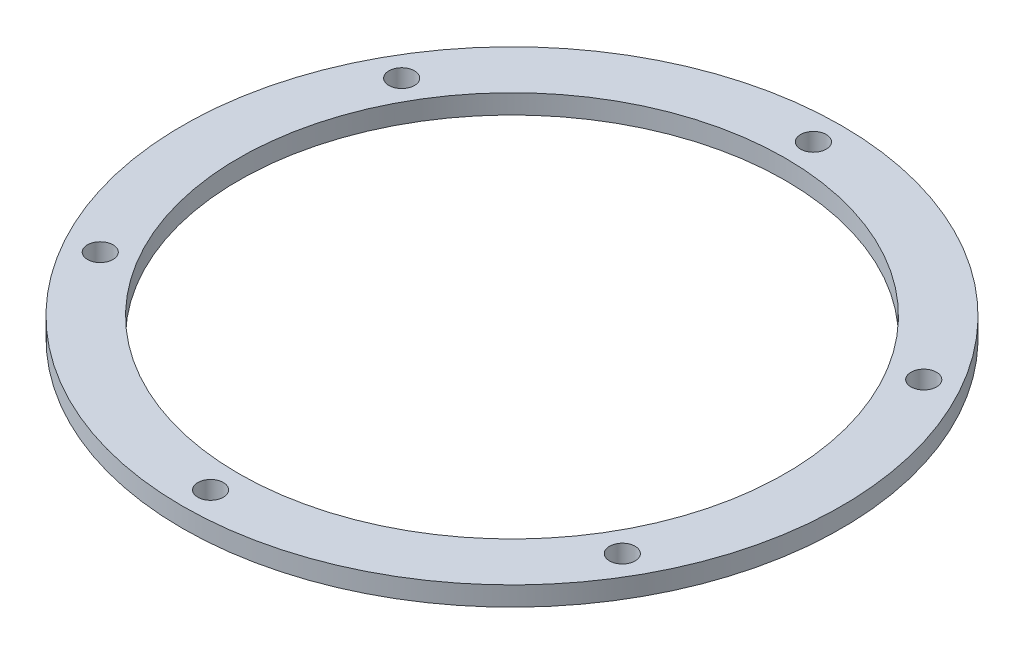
ISO-10303-21;
HEADER;
FILE_DESCRIPTION(('STEP AP214'),'2;1');
FILE_NAME('part.step','',(''),(''),'','','');
FILE_SCHEMA(('AUTOMOTIVE_DESIGN { 1 0 10303 214 1 1 1 1 }'));
ENDSEC;
DATA;
#1=APPLICATION_CONTEXT('core data for automotive mechanical design processes');
#2=APPLICATION_PROTOCOL_DEFINITION('international standard','automotive_design',2000,#1);
#3=PRODUCT_CONTEXT('',#1,'mechanical');
#4=PRODUCT('Part','Part','',(#3));
#5=PRODUCT_RELATED_PRODUCT_CATEGORY('part','',(#4));
#6=PRODUCT_DEFINITION_FORMATION('','',#4);
#7=PRODUCT_DEFINITION_CONTEXT('part definition',#1,'design');
#8=PRODUCT_DEFINITION('design','',#6,#7);
#9=PRODUCT_DEFINITION_SHAPE('','',#8);
#10=(LENGTH_UNIT() NAMED_UNIT(*) SI_UNIT(.MILLI.,.METRE.));
#11=(NAMED_UNIT(*) PLANE_ANGLE_UNIT() SI_UNIT($,.RADIAN.));
#12=(NAMED_UNIT(*) SI_UNIT($,.STERADIAN.) SOLID_ANGLE_UNIT());
#13=UNCERTAINTY_MEASURE_WITH_UNIT(LENGTH_MEASURE(1.E-05),#10,'distance_accuracy_value','');
#14=(GEOMETRIC_REPRESENTATION_CONTEXT(3) GLOBAL_UNCERTAINTY_ASSIGNED_CONTEXT((#13)) GLOBAL_UNIT_ASSIGNED_CONTEXT((#10,
#11,#12)) REPRESENTATION_CONTEXT('',''));
#15=CARTESIAN_POINT('',(0.,0.,0.));
#16=DIRECTION('',(0.,0.,1.));
#17=DIRECTION('',(1.,0.,0.));
#18=AXIS2_PLACEMENT_3D('',#15,#16,#17);
#19=CARTESIAN_POINT('',(0.,3.048,0.));
#20=DIRECTION('',(0.,1.,0.));
#21=DIRECTION('',(0.,0.,1.));
#22=AXIS2_PLACEMENT_3D('',#19,#20,#21);
#23=PLANE('',#22);
#24=CARTESIAN_POINT('',(41.2444598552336,3.048,-23.8125000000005));
#25=DIRECTION('',(0.,1.,0.));
#26=DIRECTION('',(0.,0.,1.));
#27=AXIS2_PLACEMENT_3D('',#24,#25,#26);
#28=CIRCLE('',#27,2.0193);
#29=CARTESIAN_POINT('',(41.2444598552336,3.048,-21.7932000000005));
#30=VERTEX_POINT('',#29);
#31=EDGE_CURVE('E55',#30,#30,#28,.T.);
#32=ORIENTED_EDGE('',*,*,#31,.F.);
#33=EDGE_LOOP('',(#32));
#34=FACE_BOUND('',#33,.T.);
#35=CARTESIAN_POINT('',(41.2444598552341,3.048,23.8124999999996));
#36=DIRECTION('',(0.,1.,0.));
#37=DIRECTION('',(0.,0.,1.));
#38=AXIS2_PLACEMENT_3D('',#35,#36,#37);
#39=CIRCLE('',#38,2.0193);
#40=CARTESIAN_POINT('',(41.2444598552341,3.048,25.8317999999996));
#41=VERTEX_POINT('',#40);
#42=EDGE_CURVE('E58',#41,#41,#39,.T.);
#43=ORIENTED_EDGE('',*,*,#42,.F.);
#44=EDGE_LOOP('',(#43));
#45=FACE_BOUND('',#44,.T.);
#46=CARTESIAN_POINT('',(0.,3.048,47.625));
#47=DIRECTION('',(0.,1.,0.));
#48=DIRECTION('',(0.,0.,1.));
#49=AXIS2_PLACEMENT_3D('',#46,#47,#48);
#50=CIRCLE('',#49,2.0193);
#51=CARTESIAN_POINT('',(0.,3.048,49.6443));
#52=VERTEX_POINT('',#51);
#53=EDGE_CURVE('E61',#52,#52,#50,.T.);
#54=ORIENTED_EDGE('',*,*,#53,.F.);
#55=EDGE_LOOP('',(#54));
#56=FACE_BOUND('',#55,.T.);
#57=CARTESIAN_POINT('',(-41.2444598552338,3.048,23.8125000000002));
#58=DIRECTION('',(0.,1.,0.));
#59=DIRECTION('',(0.,0.,1.));
#60=AXIS2_PLACEMENT_3D('',#57,#58,#59);
#61=CIRCLE('',#60,2.0193);
#62=CARTESIAN_POINT('',(-41.2444598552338,3.048,25.8318000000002));
#63=VERTEX_POINT('',#62);
#64=EDGE_CURVE('E64',#63,#63,#61,.T.);
#65=ORIENTED_EDGE('',*,*,#64,.F.);
#66=EDGE_LOOP('',(#65));
#67=FACE_BOUND('',#66,.T.);
#68=CARTESIAN_POINT('',(-41.2444598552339,3.048,-23.8124999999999));
#69=DIRECTION('',(0.,1.,0.));
#70=DIRECTION('',(0.,0.,1.));
#71=AXIS2_PLACEMENT_3D('',#68,#69,#70);
#72=CIRCLE('',#71,2.0193);
#73=CARTESIAN_POINT('',(-41.2444598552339,3.048,-21.7931999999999));
#74=VERTEX_POINT('',#73);
#75=EDGE_CURVE('E67',#74,#74,#72,.T.);
#76=ORIENTED_EDGE('',*,*,#75,.F.);
#77=EDGE_LOOP('',(#76));
#78=FACE_BOUND('',#77,.T.);
#79=CARTESIAN_POINT('',(0.,3.048,-47.625));
#80=DIRECTION('',(0.,1.,0.));
#81=DIRECTION('',(0.,0.,1.));
#82=AXIS2_PLACEMENT_3D('',#79,#80,#81);
#83=CIRCLE('',#82,2.0193);
#84=CARTESIAN_POINT('',(0.,3.048,-45.6057));
#85=VERTEX_POINT('',#84);
#86=EDGE_CURVE('E47',#85,#85,#83,.T.);
#87=ORIENTED_EDGE('',*,*,#86,.F.);
#88=EDGE_LOOP('',(#87));
#89=FACE_BOUND('',#88,.T.);
#90=CARTESIAN_POINT('',(0.,3.048,0.));
#91=DIRECTION('',(0.,1.,0.));
#92=DIRECTION('',(0.,0.,1.));
#93=AXIS2_PLACEMENT_3D('',#90,#91,#92);
#94=CIRCLE('',#93,52.07);
#95=CARTESIAN_POINT('',(0.,3.048,-52.07));
#96=VERTEX_POINT('',#95);
#97=EDGE_CURVE('E10',#96,#96,#94,.T.);
#98=ORIENTED_EDGE('',*,*,#97,.T.);
#99=EDGE_LOOP('',(#98));
#100=FACE_BOUND('',#99,.T.);
#101=CARTESIAN_POINT('',(0.,3.048,0.));
#102=DIRECTION('',(0.,1.,0.));
#103=DIRECTION('',(0.,0.,1.));
#104=AXIS2_PLACEMENT_3D('',#101,#102,#103);
#105=CIRCLE('',#104,43.18);
#106=CARTESIAN_POINT('',(0.,3.048,-43.18));
#107=VERTEX_POINT('',#106);
#108=EDGE_CURVE('E42',#107,#107,#105,.T.);
#109=ORIENTED_EDGE('',*,*,#108,.F.);
#110=EDGE_LOOP('',(#109));
#111=FACE_BOUND('',#110,.T.);
#112=ADVANCED_FACE('F31',(#34,#45,#56,#67,#78,#89,#100,#111),#23,.T.);
#113=CARTESIAN_POINT('',(0.,0.,0.));
#114=DIRECTION('',(0.,1.,0.));
#115=DIRECTION('',(0.,0.,1.));
#116=AXIS2_PLACEMENT_3D('',#113,#114,#115);
#117=PLANE('',#116);
#118=CARTESIAN_POINT('',(41.2444598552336,0.,-23.8125000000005));
#119=DIRECTION('',(0.,1.,0.));
#120=DIRECTION('',(-0.866025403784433,0.,0.50000000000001));
#121=AXIS2_PLACEMENT_3D('',#118,#119,#120);
#122=CIRCLE('',#121,2.0193);
#123=CARTESIAN_POINT('',(41.2444598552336,0.,-21.7932000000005));
#124=VERTEX_POINT('',#123);
#125=EDGE_CURVE('E74',#124,#124,#122,.T.);
#126=ORIENTED_EDGE('',*,*,#125,.T.);
#127=EDGE_LOOP('',(#126));
#128=FACE_BOUND('',#127,.T.);
#129=CARTESIAN_POINT('',(41.2444598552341,0.,23.8124999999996));
#130=DIRECTION('',(0.,1.,0.));
#131=DIRECTION('',(-0.866025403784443,0.,-0.499999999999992));
#132=AXIS2_PLACEMENT_3D('',#129,#130,#131);
#133=CIRCLE('',#132,2.0193);
#134=CARTESIAN_POINT('',(41.2444598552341,0.,25.8317999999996));
#135=VERTEX_POINT('',#134);
#136=EDGE_CURVE('E77',#135,#135,#133,.T.);
#137=ORIENTED_EDGE('',*,*,#136,.T.);
#138=EDGE_LOOP('',(#137));
#139=FACE_BOUND('',#138,.T.);
#140=CARTESIAN_POINT('',(0.,0.,47.625));
#141=DIRECTION('',(0.,1.,0.));
#142=DIRECTION('',(0.,0.,-1.));
#143=AXIS2_PLACEMENT_3D('',#140,#141,#142);
#144=CIRCLE('',#143,2.0193);
#145=CARTESIAN_POINT('',(0.,0.,49.6443));
#146=VERTEX_POINT('',#145);
#147=EDGE_CURVE('E80',#146,#146,#144,.T.);
#148=ORIENTED_EDGE('',*,*,#147,.T.);
#149=EDGE_LOOP('',(#148));
#150=FACE_BOUND('',#149,.T.);
#151=CARTESIAN_POINT('',(-41.2444598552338,0.,23.8125000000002));
#152=DIRECTION('',(0.,1.,0.));
#153=DIRECTION('',(0.866025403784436,0.,-0.500000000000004));
#154=AXIS2_PLACEMENT_3D('',#151,#152,#153);
#155=CIRCLE('',#154,2.0193);
#156=CARTESIAN_POINT('',(-41.2444598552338,0.,25.8318000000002));
#157=VERTEX_POINT('',#156);
#158=EDGE_CURVE('E73',#157,#157,#155,.T.);
#159=ORIENTED_EDGE('',*,*,#158,.T.);
#160=EDGE_LOOP('',(#159));
#161=FACE_BOUND('',#160,.T.);
#162=CARTESIAN_POINT('',(-41.2444598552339,0.,-23.8124999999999));
#163=DIRECTION('',(0.,1.,0.));
#164=DIRECTION('',(0.86602540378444,0.,0.499999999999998));
#165=AXIS2_PLACEMENT_3D('',#162,#163,#164);
#166=CIRCLE('',#165,2.0193);
#167=CARTESIAN_POINT('',(-41.2444598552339,0.,-21.7931999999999));
#168=VERTEX_POINT('',#167);
#169=EDGE_CURVE('E70',#168,#168,#166,.T.);
#170=ORIENTED_EDGE('',*,*,#169,.T.);
#171=EDGE_LOOP('',(#170));
#172=FACE_BOUND('',#171,.T.);
#173=CARTESIAN_POINT('',(0.,0.,-47.625));
#174=DIRECTION('',(0.,1.,0.));
#175=DIRECTION('',(0.,0.,1.));
#176=AXIS2_PLACEMENT_3D('',#173,#174,#175);
#177=CIRCLE('',#176,2.0193);
#178=CARTESIAN_POINT('',(0.,0.,-45.6057));
#179=VERTEX_POINT('',#178);
#180=EDGE_CURVE('E52',#179,#179,#177,.T.);
#181=ORIENTED_EDGE('',*,*,#180,.T.);
#182=EDGE_LOOP('',(#181));
#183=FACE_BOUND('',#182,.T.);
#184=CARTESIAN_POINT('',(0.,0.,0.));
#185=DIRECTION('',(0.,1.,0.));
#186=DIRECTION('',(0.,0.,1.));
#187=AXIS2_PLACEMENT_3D('',#184,#185,#186);
#188=CIRCLE('',#187,52.07);
#189=CARTESIAN_POINT('',(0.,0.,-52.07));
#190=VERTEX_POINT('',#189);
#191=EDGE_CURVE('E35',#190,#190,#188,.T.);
#192=ORIENTED_EDGE('',*,*,#191,.F.);
#193=EDGE_LOOP('',(#192));
#194=FACE_BOUND('',#193,.T.);
#195=CARTESIAN_POINT('',(0.,0.,0.));
#196=DIRECTION('',(0.,1.,0.));
#197=DIRECTION('',(0.,0.,1.));
#198=AXIS2_PLACEMENT_3D('',#195,#196,#197);
#199=CIRCLE('',#198,43.18);
#200=CARTESIAN_POINT('',(0.,0.,-43.18));
#201=VERTEX_POINT('',#200);
#202=EDGE_CURVE('E44',#201,#201,#199,.T.);
#203=ORIENTED_EDGE('',*,*,#202,.T.);
#204=EDGE_LOOP('',(#203));
#205=FACE_BOUND('',#204,.T.);
#206=ADVANCED_FACE('F86',(#128,#139,#150,#161,#172,#183,#194,#205),#117,.F.);
#207=CARTESIAN_POINT('',(0.,3.048,0.));
#208=DIRECTION('',(0.,-1.,0.));
#209=DIRECTION('',(0.,0.,-1.));
#210=AXIS2_PLACEMENT_3D('',#207,#208,#209);
#211=CYLINDRICAL_SURFACE('',#210,52.07);
#212=CARTESIAN_POINT('',(0.,3.048,-52.07));
#213=CARTESIAN_POINT('',(0.,3.01625,-52.07));
#214=CARTESIAN_POINT('',(0.,2.9845,-52.07));
#215=CARTESIAN_POINT('',(0.,2.921,-52.07));
#216=CARTESIAN_POINT('',(0.,2.88925,-52.07));
#217=CARTESIAN_POINT('',(0.,2.82575,-52.07));
#218=CARTESIAN_POINT('',(0.,2.794,-52.07));
#219=CARTESIAN_POINT('',(0.,2.7305,-52.07));
#220=CARTESIAN_POINT('',(0.,2.69875,-52.07));
#221=CARTESIAN_POINT('',(0.,2.63525,-52.07));
#222=CARTESIAN_POINT('',(0.,2.6035,-52.07));
#223=CARTESIAN_POINT('',(0.,2.54,-52.07));
#224=CARTESIAN_POINT('',(0.,2.50825,-52.07));
#225=CARTESIAN_POINT('',(0.,2.44475,-52.07));
#226=CARTESIAN_POINT('',(0.,2.413,-52.07));
#227=CARTESIAN_POINT('',(0.,2.3495,-52.07));
#228=CARTESIAN_POINT('',(0.,2.31775,-52.07));
#229=CARTESIAN_POINT('',(0.,2.25425,-52.07));
#230=CARTESIAN_POINT('',(0.,2.2225,-52.07));
#231=CARTESIAN_POINT('',(0.,2.159,-52.07));
#232=CARTESIAN_POINT('',(0.,2.12725,-52.07));
#233=CARTESIAN_POINT('',(0.,2.06375,-52.07));
#234=CARTESIAN_POINT('',(0.,2.032,-52.07));
#235=CARTESIAN_POINT('',(0.,1.9685,-52.07));
#236=CARTESIAN_POINT('',(0.,1.93675,-52.07));
#237=CARTESIAN_POINT('',(0.,1.87325,-52.07));
#238=CARTESIAN_POINT('',(0.,1.8415,-52.07));
#239=CARTESIAN_POINT('',(0.,1.778,-52.07));
#240=CARTESIAN_POINT('',(0.,1.74625,-52.07));
#241=CARTESIAN_POINT('',(0.,1.68275,-52.07));
#242=CARTESIAN_POINT('',(0.,1.651,-52.07));
#243=CARTESIAN_POINT('',(0.,1.5875,-52.07));
#244=CARTESIAN_POINT('',(0.,1.55575,-52.07));
#245=CARTESIAN_POINT('',(0.,1.49225,-52.07));
#246=CARTESIAN_POINT('',(0.,1.4605,-52.07));
#247=CARTESIAN_POINT('',(0.,1.397,-52.07));
#248=CARTESIAN_POINT('',(0.,1.36525,-52.07));
#249=CARTESIAN_POINT('',(0.,1.30175,-52.07));
#250=CARTESIAN_POINT('',(0.,1.27,-52.07));
#251=CARTESIAN_POINT('',(0.,1.2065,-52.07));
#252=CARTESIAN_POINT('',(0.,1.17475,-52.07));
#253=CARTESIAN_POINT('',(0.,1.11125,-52.07));
#254=CARTESIAN_POINT('',(0.,1.0795,-52.07));
#255=CARTESIAN_POINT('',(0.,1.016,-52.07));
#256=CARTESIAN_POINT('',(0.,0.98425,-52.07));
#257=CARTESIAN_POINT('',(0.,0.92075,-52.07));
#258=CARTESIAN_POINT('',(0.,0.889,-52.07));
#259=CARTESIAN_POINT('',(0.,0.8255,-52.07));
#260=CARTESIAN_POINT('',(0.,0.79375,-52.07));
#261=CARTESIAN_POINT('',(0.,0.73025,-52.07));
#262=CARTESIAN_POINT('',(0.,0.6985,-52.07));
#263=CARTESIAN_POINT('',(0.,0.635,-52.07));
#264=CARTESIAN_POINT('',(0.,0.60325,-52.07));
#265=CARTESIAN_POINT('',(0.,0.53975,-52.07));
#266=CARTESIAN_POINT('',(0.,0.508,-52.07));
#267=CARTESIAN_POINT('',(0.,0.4445,-52.07));
#268=CARTESIAN_POINT('',(0.,0.41275,-52.07));
#269=CARTESIAN_POINT('',(0.,0.34925,-52.07));
#270=CARTESIAN_POINT('',(0.,0.3175,-52.07));
#271=CARTESIAN_POINT('',(0.,0.254,-52.07));
#272=CARTESIAN_POINT('',(0.,0.22225,-52.07));
#273=CARTESIAN_POINT('',(0.,0.15875,-52.07));
#274=CARTESIAN_POINT('',(0.,0.127,-52.07));
#275=CARTESIAN_POINT('',(0.,0.0634999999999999,-52.07));
#276=CARTESIAN_POINT('',(0.,0.03175,-52.07));
#277=CARTESIAN_POINT('',(0.,0.,-52.07));
#278=B_SPLINE_CURVE_WITH_KNOTS('',3,(#212,#213,#214,#215,#216,#217,#218,#219,#220,#221,#222,
#223,#224,#225,#226,#227,#228,#229,#230,#231,#232,#233,#234,#235,#236,#237,#238,#239,#240,#241,
#242,#243,#244,#245,#246,#247,#248,#249,#250,#251,#252,#253,#254,#255,#256,#257,#258,#259,#260,
#261,#262,#263,#264,#265,#266,#267,#268,#269,#270,#271,#272,#273,#274,#275,#276,#277),
.UNSPECIFIED.,.F.,.F.,(4,2,2,2,2,2,2,2,2,2,2,2,2,2,2,2,2,2,2,2,2,2,2,2,2,2,2,2,2,2,2,2,4),(0.,
0.0952500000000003,0.1905,0.28575,0.381,0.47625,0.5715,0.66675,0.762,0.85725,0.9525,1.04775,
1.143,1.23825,1.3335,1.42875,1.524,1.61925,1.7145,1.80975,1.905,2.00025,2.0955,2.19075,2.286,
2.38125,2.4765,2.57175,2.667,2.76225,2.8575,2.95275,3.048),.UNSPECIFIED.);
#279=EDGE_CURVE('BSEAM33',#96,#190,#278,.T.);
#280=ORIENTED_EDGE('',*,*,#97,.F.);
#281=ORIENTED_EDGE('',*,*,#191,.T.);
#282=ORIENTED_EDGE('',*,*,#279,.T.);
#283=ORIENTED_EDGE('',*,*,#279,.F.);
#284=EDGE_LOOP('',(#280,#282,#281,#283));
#285=FACE_BOUND('',#284,.T.);
#286=ADVANCED_FACE('F33',(#285),#211,.T.);
#287=CARTESIAN_POINT('',(0.,3.048,0.));
#288=DIRECTION('',(0.,-1.,0.));
#289=DIRECTION('',(0.,0.,-1.));
#290=AXIS2_PLACEMENT_3D('',#287,#288,#289);
#291=CYLINDRICAL_SURFACE('',#290,43.18);
#292=CARTESIAN_POINT('',(0.,3.048,-43.18));
#293=CARTESIAN_POINT('',(0.,3.01625,-43.18));
#294=CARTESIAN_POINT('',(0.,2.9845,-43.18));
#295=CARTESIAN_POINT('',(0.,2.921,-43.18));
#296=CARTESIAN_POINT('',(0.,2.88925,-43.18));
#297=CARTESIAN_POINT('',(0.,2.82575,-43.18));
#298=CARTESIAN_POINT('',(0.,2.794,-43.18));
#299=CARTESIAN_POINT('',(0.,2.7305,-43.18));
#300=CARTESIAN_POINT('',(0.,2.69875,-43.18));
#301=CARTESIAN_POINT('',(0.,2.63525,-43.18));
#302=CARTESIAN_POINT('',(0.,2.6035,-43.18));
#303=CARTESIAN_POINT('',(0.,2.54,-43.18));
#304=CARTESIAN_POINT('',(0.,2.50825,-43.18));
#305=CARTESIAN_POINT('',(0.,2.44475,-43.18));
#306=CARTESIAN_POINT('',(0.,2.413,-43.18));
#307=CARTESIAN_POINT('',(0.,2.3495,-43.18));
#308=CARTESIAN_POINT('',(0.,2.31775,-43.18));
#309=CARTESIAN_POINT('',(0.,2.25425,-43.18));
#310=CARTESIAN_POINT('',(0.,2.2225,-43.18));
#311=CARTESIAN_POINT('',(0.,2.159,-43.18));
#312=CARTESIAN_POINT('',(0.,2.12725,-43.18));
#313=CARTESIAN_POINT('',(0.,2.06375,-43.18));
#314=CARTESIAN_POINT('',(0.,2.032,-43.18));
#315=CARTESIAN_POINT('',(0.,1.9685,-43.18));
#316=CARTESIAN_POINT('',(0.,1.93675,-43.18));
#317=CARTESIAN_POINT('',(0.,1.87325,-43.18));
#318=CARTESIAN_POINT('',(0.,1.8415,-43.18));
#319=CARTESIAN_POINT('',(0.,1.778,-43.18));
#320=CARTESIAN_POINT('',(0.,1.74625,-43.18));
#321=CARTESIAN_POINT('',(0.,1.68275,-43.18));
#322=CARTESIAN_POINT('',(0.,1.651,-43.18));
#323=CARTESIAN_POINT('',(0.,1.5875,-43.18));
#324=CARTESIAN_POINT('',(0.,1.55575,-43.18));
#325=CARTESIAN_POINT('',(0.,1.49225,-43.18));
#326=CARTESIAN_POINT('',(0.,1.4605,-43.18));
#327=CARTESIAN_POINT('',(0.,1.397,-43.18));
#328=CARTESIAN_POINT('',(0.,1.36525,-43.18));
#329=CARTESIAN_POINT('',(0.,1.30175,-43.18));
#330=CARTESIAN_POINT('',(0.,1.27,-43.18));
#331=CARTESIAN_POINT('',(0.,1.2065,-43.18));
#332=CARTESIAN_POINT('',(0.,1.17475,-43.18));
#333=CARTESIAN_POINT('',(0.,1.11125,-43.18));
#334=CARTESIAN_POINT('',(0.,1.0795,-43.18));
#335=CARTESIAN_POINT('',(0.,1.016,-43.18));
#336=CARTESIAN_POINT('',(0.,0.98425,-43.18));
#337=CARTESIAN_POINT('',(0.,0.92075,-43.18));
#338=CARTESIAN_POINT('',(0.,0.889,-43.18));
#339=CARTESIAN_POINT('',(0.,0.8255,-43.18));
#340=CARTESIAN_POINT('',(0.,0.79375,-43.18));
#341=CARTESIAN_POINT('',(0.,0.73025,-43.18));
#342=CARTESIAN_POINT('',(0.,0.6985,-43.18));
#343=CARTESIAN_POINT('',(0.,0.635,-43.18));
#344=CARTESIAN_POINT('',(0.,0.60325,-43.18));
#345=CARTESIAN_POINT('',(0.,0.53975,-43.18));
#346=CARTESIAN_POINT('',(0.,0.508,-43.18));
#347=CARTESIAN_POINT('',(0.,0.4445,-43.18));
#348=CARTESIAN_POINT('',(0.,0.41275,-43.18));
#349=CARTESIAN_POINT('',(0.,0.34925,-43.18));
#350=CARTESIAN_POINT('',(0.,0.3175,-43.18));
#351=CARTESIAN_POINT('',(0.,0.254,-43.18));
#352=CARTESIAN_POINT('',(0.,0.22225,-43.18));
#353=CARTESIAN_POINT('',(0.,0.15875,-43.18));
#354=CARTESIAN_POINT('',(0.,0.127,-43.18));
#355=CARTESIAN_POINT('',(0.,0.0634999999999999,-43.18));
#356=CARTESIAN_POINT('',(0.,0.03175,-43.18));
#357=CARTESIAN_POINT('',(0.,0.,-43.18));
#358=B_SPLINE_CURVE_WITH_KNOTS('',3,(#292,#293,#294,#295,#296,#297,#298,#299,#300,#301,#302,
#303,#304,#305,#306,#307,#308,#309,#310,#311,#312,#313,#314,#315,#316,#317,#318,#319,#320,#321,
#322,#323,#324,#325,#326,#327,#328,#329,#330,#331,#332,#333,#334,#335,#336,#337,#338,#339,#340,
#341,#342,#343,#344,#345,#346,#347,#348,#349,#350,#351,#352,#353,#354,#355,#356,#357),
.UNSPECIFIED.,.F.,.F.,(4,2,2,2,2,2,2,2,2,2,2,2,2,2,2,2,2,2,2,2,2,2,2,2,2,2,2,2,2,2,2,2,4),(0.,
0.0952499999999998,0.1905,0.28575,0.381,0.47625,0.5715,0.66675,0.762,0.85725,0.9525,1.04775,
1.143,1.23825,1.3335,1.42875,1.524,1.61925,1.7145,1.80975,1.905,2.00025,2.0955,2.19075,2.286,
2.38125,2.4765,2.57175,2.667,2.76225,2.8575,2.95275,3.048),.UNSPECIFIED.);
#359=EDGE_CURVE('BSEAM115',#107,#201,#358,.T.);
#360=ORIENTED_EDGE('',*,*,#108,.T.);
#361=ORIENTED_EDGE('',*,*,#202,.F.);
#362=ORIENTED_EDGE('',*,*,#359,.T.);
#363=ORIENTED_EDGE('',*,*,#359,.F.);
#364=EDGE_LOOP('',(#360,#362,#361,#363));
#365=FACE_BOUND('',#364,.T.);
#366=ADVANCED_FACE('F115',(#365),#291,.F.);
#367=CARTESIAN_POINT('',(0.,0.,-47.625));
#368=DIRECTION('',(0.,1.,0.));
#369=DIRECTION('',(0.,0.,1.));
#370=AXIS2_PLACEMENT_3D('',#367,#368,#369);
#371=CYLINDRICAL_SURFACE('',#370,2.0193);
#372=CARTESIAN_POINT('',(0.,3.048,-45.6057));
#373=CARTESIAN_POINT('',(0.,3.01625,-45.6057));
#374=CARTESIAN_POINT('',(0.,2.9845,-45.6057));
#375=CARTESIAN_POINT('',(0.,2.921,-45.6057));
#376=CARTESIAN_POINT('',(0.,2.88925,-45.6057));
#377=CARTESIAN_POINT('',(0.,2.82575,-45.6057));
#378=CARTESIAN_POINT('',(0.,2.794,-45.6057));
#379=CARTESIAN_POINT('',(0.,2.7305,-45.6057));
#380=CARTESIAN_POINT('',(0.,2.69875,-45.6057));
#381=CARTESIAN_POINT('',(0.,2.63525,-45.6057));
#382=CARTESIAN_POINT('',(0.,2.6035,-45.6057));
#383=CARTESIAN_POINT('',(0.,2.54,-45.6057));
#384=CARTESIAN_POINT('',(0.,2.50825,-45.6057));
#385=CARTESIAN_POINT('',(0.,2.44475,-45.6057));
#386=CARTESIAN_POINT('',(0.,2.413,-45.6057));
#387=CARTESIAN_POINT('',(0.,2.3495,-45.6057));
#388=CARTESIAN_POINT('',(0.,2.31775,-45.6057));
#389=CARTESIAN_POINT('',(0.,2.25425,-45.6057));
#390=CARTESIAN_POINT('',(0.,2.2225,-45.6057));
#391=CARTESIAN_POINT('',(0.,2.159,-45.6057));
#392=CARTESIAN_POINT('',(0.,2.12725,-45.6057));
#393=CARTESIAN_POINT('',(0.,2.06375,-45.6057));
#394=CARTESIAN_POINT('',(0.,2.032,-45.6057));
#395=CARTESIAN_POINT('',(0.,1.9685,-45.6057));
#396=CARTESIAN_POINT('',(0.,1.93675,-45.6057));
#397=CARTESIAN_POINT('',(0.,1.87325,-45.6057));
#398=CARTESIAN_POINT('',(0.,1.8415,-45.6057));
#399=CARTESIAN_POINT('',(0.,1.778,-45.6057));
#400=CARTESIAN_POINT('',(0.,1.74625,-45.6057));
#401=CARTESIAN_POINT('',(0.,1.68275,-45.6057));
#402=CARTESIAN_POINT('',(0.,1.651,-45.6057));
#403=CARTESIAN_POINT('',(0.,1.5875,-45.6057));
#404=CARTESIAN_POINT('',(0.,1.55575,-45.6057));
#405=CARTESIAN_POINT('',(0.,1.49225,-45.6057));
#406=CARTESIAN_POINT('',(0.,1.4605,-45.6057));
#407=CARTESIAN_POINT('',(0.,1.397,-45.6057));
#408=CARTESIAN_POINT('',(0.,1.36525,-45.6057));
#409=CARTESIAN_POINT('',(0.,1.30175,-45.6057));
#410=CARTESIAN_POINT('',(0.,1.27,-45.6057));
#411=CARTESIAN_POINT('',(0.,1.2065,-45.6057));
#412=CARTESIAN_POINT('',(0.,1.17475,-45.6057));
#413=CARTESIAN_POINT('',(0.,1.11125,-45.6057));
#414=CARTESIAN_POINT('',(0.,1.0795,-45.6057));
#415=CARTESIAN_POINT('',(0.,1.016,-45.6057));
#416=CARTESIAN_POINT('',(0.,0.98425,-45.6057));
#417=CARTESIAN_POINT('',(0.,0.92075,-45.6057));
#418=CARTESIAN_POINT('',(0.,0.889,-45.6057));
#419=CARTESIAN_POINT('',(0.,0.8255,-45.6057));
#420=CARTESIAN_POINT('',(0.,0.79375,-45.6057));
#421=CARTESIAN_POINT('',(0.,0.73025,-45.6057));
#422=CARTESIAN_POINT('',(0.,0.6985,-45.6057));
#423=CARTESIAN_POINT('',(0.,0.635,-45.6057));
#424=CARTESIAN_POINT('',(0.,0.60325,-45.6057));
#425=CARTESIAN_POINT('',(0.,0.53975,-45.6057));
#426=CARTESIAN_POINT('',(0.,0.508,-45.6057));
#427=CARTESIAN_POINT('',(0.,0.4445,-45.6057));
#428=CARTESIAN_POINT('',(0.,0.41275,-45.6057));
#429=CARTESIAN_POINT('',(0.,0.34925,-45.6057));
#430=CARTESIAN_POINT('',(0.,0.3175,-45.6057));
#431=CARTESIAN_POINT('',(0.,0.254,-45.6057));
#432=CARTESIAN_POINT('',(0.,0.22225,-45.6057));
#433=CARTESIAN_POINT('',(0.,0.15875,-45.6057));
#434=CARTESIAN_POINT('',(0.,0.127,-45.6057));
#435=CARTESIAN_POINT('',(0.,0.0634999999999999,-45.6057));
#436=CARTESIAN_POINT('',(0.,0.03175,-45.6057));
#437=CARTESIAN_POINT('',(0.,0.,-45.6057));
#438=B_SPLINE_CURVE_WITH_KNOTS('',3,(#372,#373,#374,#375,#376,#377,#378,#379,#380,#381,#382,
#383,#384,#385,#386,#387,#388,#389,#390,#391,#392,#393,#394,#395,#396,#397,#398,#399,#400,#401,
#402,#403,#404,#405,#406,#407,#408,#409,#410,#411,#412,#413,#414,#415,#416,#417,#418,#419,#420,
#421,#422,#423,#424,#425,#426,#427,#428,#429,#430,#431,#432,#433,#434,#435,#436,#437),
.UNSPECIFIED.,.F.,.F.,(4,2,2,2,2,2,2,2,2,2,2,2,2,2,2,2,2,2,2,2,2,2,2,2,2,2,2,2,2,2,2,2,4),(0.,
0.0952499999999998,0.1905,0.28575,0.381,0.47625,0.5715,0.66675,0.762,0.85725,0.9525,1.04775,
1.143,1.23825,1.3335,1.42875,1.524,1.61925,1.7145,1.80975,1.905,2.00025,2.0955,2.19075,2.286,
2.38125,2.4765,2.57175,2.667,2.76225,2.8575,2.95275,3.048),.UNSPECIFIED.);
#439=EDGE_CURVE('BSEAM102',#85,#179,#438,.T.);
#440=ORIENTED_EDGE('',*,*,#86,.T.);
#441=ORIENTED_EDGE('',*,*,#180,.F.);
#442=ORIENTED_EDGE('',*,*,#439,.T.);
#443=ORIENTED_EDGE('',*,*,#439,.F.);
#444=EDGE_LOOP('',(#440,#442,#441,#443));
#445=FACE_BOUND('',#444,.T.);
#446=ADVANCED_FACE('F102',(#445),#371,.F.);
#447=CARTESIAN_POINT('',(-41.2444598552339,0.,-23.8124999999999));
#448=DIRECTION('',(0.,1.,0.));
#449=DIRECTION('',(0.,0.,1.));
#450=AXIS2_PLACEMENT_3D('',#447,#448,#449);
#451=CYLINDRICAL_SURFACE('',#450,2.0193);
#452=CARTESIAN_POINT('',(-41.2444598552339,3.048,-21.7931999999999));
#453=CARTESIAN_POINT('',(-41.2444598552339,3.01625,-21.7931999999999));
#454=CARTESIAN_POINT('',(-41.2444598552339,2.9845,-21.7931999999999));
#455=CARTESIAN_POINT('',(-41.2444598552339,2.921,-21.7931999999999));
#456=CARTESIAN_POINT('',(-41.2444598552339,2.88925,-21.7931999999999));
#457=CARTESIAN_POINT('',(-41.2444598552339,2.82575,-21.7931999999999));
#458=CARTESIAN_POINT('',(-41.2444598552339,2.794,-21.7931999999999));
#459=CARTESIAN_POINT('',(-41.2444598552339,2.7305,-21.7931999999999));
#460=CARTESIAN_POINT('',(-41.2444598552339,2.69875,-21.7931999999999));
#461=CARTESIAN_POINT('',(-41.2444598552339,2.63525,-21.7931999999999));
#462=CARTESIAN_POINT('',(-41.2444598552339,2.6035,-21.7931999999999));
#463=CARTESIAN_POINT('',(-41.2444598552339,2.54,-21.7931999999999));
#464=CARTESIAN_POINT('',(-41.2444598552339,2.50825,-21.7931999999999));
#465=CARTESIAN_POINT('',(-41.2444598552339,2.44475,-21.7931999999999));
#466=CARTESIAN_POINT('',(-41.2444598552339,2.413,-21.7931999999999));
#467=CARTESIAN_POINT('',(-41.2444598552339,2.3495,-21.7931999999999));
#468=CARTESIAN_POINT('',(-41.2444598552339,2.31775,-21.7931999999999));
#469=CARTESIAN_POINT('',(-41.2444598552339,2.25425,-21.7931999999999));
#470=CARTESIAN_POINT('',(-41.2444598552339,2.2225,-21.7931999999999));
#471=CARTESIAN_POINT('',(-41.2444598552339,2.159,-21.7931999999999));
#472=CARTESIAN_POINT('',(-41.2444598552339,2.12725,-21.7931999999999));
#473=CARTESIAN_POINT('',(-41.2444598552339,2.06375,-21.7931999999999));
#474=CARTESIAN_POINT('',(-41.2444598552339,2.032,-21.7931999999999));
#475=CARTESIAN_POINT('',(-41.2444598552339,1.9685,-21.7931999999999));
#476=CARTESIAN_POINT('',(-41.2444598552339,1.93675,-21.7931999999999));
#477=CARTESIAN_POINT('',(-41.2444598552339,1.87325,-21.7931999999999));
#478=CARTESIAN_POINT('',(-41.2444598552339,1.8415,-21.7931999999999));
#479=CARTESIAN_POINT('',(-41.2444598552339,1.778,-21.7931999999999));
#480=CARTESIAN_POINT('',(-41.2444598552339,1.74625,-21.7931999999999));
#481=CARTESIAN_POINT('',(-41.2444598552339,1.68275,-21.7931999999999));
#482=CARTESIAN_POINT('',(-41.2444598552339,1.651,-21.7931999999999));
#483=CARTESIAN_POINT('',(-41.2444598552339,1.5875,-21.7931999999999));
#484=CARTESIAN_POINT('',(-41.2444598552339,1.55575,-21.7931999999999));
#485=CARTESIAN_POINT('',(-41.2444598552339,1.49225,-21.7931999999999));
#486=CARTESIAN_POINT('',(-41.2444598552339,1.4605,-21.7931999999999));
#487=CARTESIAN_POINT('',(-41.2444598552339,1.397,-21.7931999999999));
#488=CARTESIAN_POINT('',(-41.2444598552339,1.36525,-21.7931999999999));
#489=CARTESIAN_POINT('',(-41.2444598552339,1.30175,-21.7931999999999));
#490=CARTESIAN_POINT('',(-41.2444598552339,1.27,-21.7931999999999));
#491=CARTESIAN_POINT('',(-41.2444598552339,1.2065,-21.7931999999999));
#492=CARTESIAN_POINT('',(-41.2444598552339,1.17475,-21.7931999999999));
#493=CARTESIAN_POINT('',(-41.2444598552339,1.11125,-21.7931999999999));
#494=CARTESIAN_POINT('',(-41.2444598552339,1.0795,-21.7931999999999));
#495=CARTESIAN_POINT('',(-41.2444598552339,1.016,-21.7931999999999));
#496=CARTESIAN_POINT('',(-41.2444598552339,0.98425,-21.7931999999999));
#497=CARTESIAN_POINT('',(-41.2444598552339,0.92075,-21.7931999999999));
#498=CARTESIAN_POINT('',(-41.2444598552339,0.889,-21.7931999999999));
#499=CARTESIAN_POINT('',(-41.2444598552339,0.8255,-21.7931999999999));
#500=CARTESIAN_POINT('',(-41.2444598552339,0.79375,-21.7931999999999));
#501=CARTESIAN_POINT('',(-41.2444598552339,0.73025,-21.7931999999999));
#502=CARTESIAN_POINT('',(-41.2444598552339,0.6985,-21.7931999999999));
#503=CARTESIAN_POINT('',(-41.2444598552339,0.635,-21.7931999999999));
#504=CARTESIAN_POINT('',(-41.2444598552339,0.60325,-21.7931999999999));
#505=CARTESIAN_POINT('',(-41.2444598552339,0.53975,-21.7931999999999));
#506=CARTESIAN_POINT('',(-41.2444598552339,0.508,-21.7931999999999));
#507=CARTESIAN_POINT('',(-41.2444598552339,0.4445,-21.7931999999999));
#508=CARTESIAN_POINT('',(-41.2444598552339,0.41275,-21.7931999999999));
#509=CARTESIAN_POINT('',(-41.2444598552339,0.34925,-21.7931999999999));
#510=CARTESIAN_POINT('',(-41.2444598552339,0.3175,-21.7931999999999));
#511=CARTESIAN_POINT('',(-41.2444598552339,0.254,-21.7931999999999));
#512=CARTESIAN_POINT('',(-41.2444598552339,0.22225,-21.7931999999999));
#513=CARTESIAN_POINT('',(-41.2444598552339,0.15875,-21.7931999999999));
#514=CARTESIAN_POINT('',(-41.2444598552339,0.127,-21.7931999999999));
#515=CARTESIAN_POINT('',(-41.2444598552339,0.0634999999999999,-21.7931999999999));
#516=CARTESIAN_POINT('',(-41.2444598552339,0.03175,-21.7931999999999));
#517=CARTESIAN_POINT('',(-41.2444598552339,0.,-21.7931999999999));
#518=B_SPLINE_CURVE_WITH_KNOTS('',3,(#452,#453,#454,#455,#456,#457,#458,#459,#460,#461,#462,
#463,#464,#465,#466,#467,#468,#469,#470,#471,#472,#473,#474,#475,#476,#477,#478,#479,#480,#481,
#482,#483,#484,#485,#486,#487,#488,#489,#490,#491,#492,#493,#494,#495,#496,#497,#498,#499,#500,
#501,#502,#503,#504,#505,#506,#507,#508,#509,#510,#511,#512,#513,#514,#515,#516,#517),
.UNSPECIFIED.,.F.,.F.,(4,2,2,2,2,2,2,2,2,2,2,2,2,2,2,2,2,2,2,2,2,2,2,2,2,2,2,2,2,2,2,2,4),(0.,
0.0952499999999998,0.1905,0.28575,0.381,0.47625,0.5715,0.66675,0.762,0.85725,0.9525,1.04775,
1.143,1.23825,1.3335,1.42875,1.524,1.61925,1.7145,1.80975,1.905,2.00025,2.0955,2.19075,2.286,
2.38125,2.4765,2.57175,2.667,2.76225,2.8575,2.95275,3.048),.UNSPECIFIED.);
#519=EDGE_CURVE('BSEAM92',#74,#168,#518,.T.);
#520=ORIENTED_EDGE('',*,*,#75,.T.);
#521=ORIENTED_EDGE('',*,*,#169,.F.);
#522=ORIENTED_EDGE('',*,*,#519,.T.);
#523=ORIENTED_EDGE('',*,*,#519,.F.);
#524=EDGE_LOOP('',(#520,#522,#521,#523));
#525=FACE_BOUND('',#524,.T.);
#526=ADVANCED_FACE('F92',(#525),#451,.F.);
#527=CARTESIAN_POINT('',(-41.2444598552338,0.,23.8125000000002));
#528=DIRECTION('',(0.,1.,0.));
#529=DIRECTION('',(0.,0.,1.));
#530=AXIS2_PLACEMENT_3D('',#527,#528,#529);
#531=CYLINDRICAL_SURFACE('',#530,2.0193);
#532=CARTESIAN_POINT('',(-41.2444598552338,3.048,25.8318000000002));
#533=CARTESIAN_POINT('',(-41.2444598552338,3.01625,25.8318000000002));
#534=CARTESIAN_POINT('',(-41.2444598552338,2.9845,25.8318000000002));
#535=CARTESIAN_POINT('',(-41.2444598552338,2.921,25.8318000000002));
#536=CARTESIAN_POINT('',(-41.2444598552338,2.88925,25.8318000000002));
#537=CARTESIAN_POINT('',(-41.2444598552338,2.82575,25.8318000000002));
#538=CARTESIAN_POINT('',(-41.2444598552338,2.794,25.8318000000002));
#539=CARTESIAN_POINT('',(-41.2444598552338,2.7305,25.8318000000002));
#540=CARTESIAN_POINT('',(-41.2444598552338,2.69875,25.8318000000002));
#541=CARTESIAN_POINT('',(-41.2444598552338,2.63525,25.8318000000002));
#542=CARTESIAN_POINT('',(-41.2444598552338,2.6035,25.8318000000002));
#543=CARTESIAN_POINT('',(-41.2444598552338,2.54,25.8318000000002));
#544=CARTESIAN_POINT('',(-41.2444598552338,2.50825,25.8318000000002));
#545=CARTESIAN_POINT('',(-41.2444598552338,2.44475,25.8318000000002));
#546=CARTESIAN_POINT('',(-41.2444598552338,2.413,25.8318000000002));
#547=CARTESIAN_POINT('',(-41.2444598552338,2.3495,25.8318000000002));
#548=CARTESIAN_POINT('',(-41.2444598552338,2.31775,25.8318000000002));
#549=CARTESIAN_POINT('',(-41.2444598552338,2.25425,25.8318000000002));
#550=CARTESIAN_POINT('',(-41.2444598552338,2.2225,25.8318000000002));
#551=CARTESIAN_POINT('',(-41.2444598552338,2.159,25.8318000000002));
#552=CARTESIAN_POINT('',(-41.2444598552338,2.12725,25.8318000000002));
#553=CARTESIAN_POINT('',(-41.2444598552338,2.06375,25.8318000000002));
#554=CARTESIAN_POINT('',(-41.2444598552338,2.032,25.8318000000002));
#555=CARTESIAN_POINT('',(-41.2444598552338,1.9685,25.8318000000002));
#556=CARTESIAN_POINT('',(-41.2444598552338,1.93675,25.8318000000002));
#557=CARTESIAN_POINT('',(-41.2444598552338,1.87325,25.8318000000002));
#558=CARTESIAN_POINT('',(-41.2444598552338,1.8415,25.8318000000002));
#559=CARTESIAN_POINT('',(-41.2444598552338,1.778,25.8318000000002));
#560=CARTESIAN_POINT('',(-41.2444598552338,1.74625,25.8318000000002));
#561=CARTESIAN_POINT('',(-41.2444598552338,1.68275,25.8318000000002));
#562=CARTESIAN_POINT('',(-41.2444598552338,1.651,25.8318000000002));
#563=CARTESIAN_POINT('',(-41.2444598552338,1.5875,25.8318000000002));
#564=CARTESIAN_POINT('',(-41.2444598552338,1.55575,25.8318000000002));
#565=CARTESIAN_POINT('',(-41.2444598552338,1.49225,25.8318000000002));
#566=CARTESIAN_POINT('',(-41.2444598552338,1.4605,25.8318000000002));
#567=CARTESIAN_POINT('',(-41.2444598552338,1.397,25.8318000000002));
#568=CARTESIAN_POINT('',(-41.2444598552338,1.36525,25.8318000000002));
#569=CARTESIAN_POINT('',(-41.2444598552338,1.30175,25.8318000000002));
#570=CARTESIAN_POINT('',(-41.2444598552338,1.27,25.8318000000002));
#571=CARTESIAN_POINT('',(-41.2444598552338,1.2065,25.8318000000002));
#572=CARTESIAN_POINT('',(-41.2444598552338,1.17475,25.8318000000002));
#573=CARTESIAN_POINT('',(-41.2444598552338,1.11125,25.8318000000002));
#574=CARTESIAN_POINT('',(-41.2444598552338,1.0795,25.8318000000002));
#575=CARTESIAN_POINT('',(-41.2444598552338,1.016,25.8318000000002));
#576=CARTESIAN_POINT('',(-41.2444598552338,0.98425,25.8318000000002));
#577=CARTESIAN_POINT('',(-41.2444598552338,0.92075,25.8318000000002));
#578=CARTESIAN_POINT('',(-41.2444598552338,0.889,25.8318000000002));
#579=CARTESIAN_POINT('',(-41.2444598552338,0.8255,25.8318000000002));
#580=CARTESIAN_POINT('',(-41.2444598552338,0.79375,25.8318000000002));
#581=CARTESIAN_POINT('',(-41.2444598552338,0.73025,25.8318000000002));
#582=CARTESIAN_POINT('',(-41.2444598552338,0.6985,25.8318000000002));
#583=CARTESIAN_POINT('',(-41.2444598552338,0.635,25.8318000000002));
#584=CARTESIAN_POINT('',(-41.2444598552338,0.60325,25.8318000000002));
#585=CARTESIAN_POINT('',(-41.2444598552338,0.53975,25.8318000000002));
#586=CARTESIAN_POINT('',(-41.2444598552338,0.508,25.8318000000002));
#587=CARTESIAN_POINT('',(-41.2444598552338,0.4445,25.8318000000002));
#588=CARTESIAN_POINT('',(-41.2444598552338,0.41275,25.8318000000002));
#589=CARTESIAN_POINT('',(-41.2444598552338,0.34925,25.8318000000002));
#590=CARTESIAN_POINT('',(-41.2444598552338,0.3175,25.8318000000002));
#591=CARTESIAN_POINT('',(-41.2444598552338,0.254,25.8318000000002));
#592=CARTESIAN_POINT('',(-41.2444598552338,0.22225,25.8318000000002));
#593=CARTESIAN_POINT('',(-41.2444598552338,0.15875,25.8318000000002));
#594=CARTESIAN_POINT('',(-41.2444598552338,0.127,25.8318000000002));
#595=CARTESIAN_POINT('',(-41.2444598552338,0.0634999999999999,25.8318000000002));
#596=CARTESIAN_POINT('',(-41.2444598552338,0.03175,25.8318000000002));
#597=CARTESIAN_POINT('',(-41.2444598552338,0.,25.8318000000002));
#598=B_SPLINE_CURVE_WITH_KNOTS('',3,(#532,#533,#534,#535,#536,#537,#538,#539,#540,#541,#542,
#543,#544,#545,#546,#547,#548,#549,#550,#551,#552,#553,#554,#555,#556,#557,#558,#559,#560,#561,
#562,#563,#564,#565,#566,#567,#568,#569,#570,#571,#572,#573,#574,#575,#576,#577,#578,#579,#580,
#581,#582,#583,#584,#585,#586,#587,#588,#589,#590,#591,#592,#593,#594,#595,#596,#597),
.UNSPECIFIED.,.F.,.F.,(4,2,2,2,2,2,2,2,2,2,2,2,2,2,2,2,2,2,2,2,2,2,2,2,2,2,2,2,2,2,2,2,4),(0.,
0.0952499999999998,0.1905,0.28575,0.381,0.47625,0.5715,0.66675,0.762,0.85725,0.9525,1.04775,
1.143,1.23825,1.3335,1.42875,1.524,1.61925,1.7145,1.80975,1.905,2.00025,2.0955,2.19075,2.286,
2.38125,2.4765,2.57175,2.667,2.76225,2.8575,2.95275,3.048),.UNSPECIFIED.);
#599=EDGE_CURVE('BSEAM89',#63,#157,#598,.T.);
#600=ORIENTED_EDGE('',*,*,#64,.T.);
#601=ORIENTED_EDGE('',*,*,#158,.F.);
#602=ORIENTED_EDGE('',*,*,#599,.T.);
#603=ORIENTED_EDGE('',*,*,#599,.F.);
#604=EDGE_LOOP('',(#600,#602,#601,#603));
#605=FACE_BOUND('',#604,.T.);
#606=ADVANCED_FACE('F89',(#605),#531,.F.);
#607=CARTESIAN_POINT('',(0.,0.,47.625));
#608=DIRECTION('',(0.,1.,0.));
#609=DIRECTION('',(0.,0.,1.));
#610=AXIS2_PLACEMENT_3D('',#607,#608,#609);
#611=CYLINDRICAL_SURFACE('',#610,2.0193);
#612=CARTESIAN_POINT('',(0.,3.048,49.6443));
#613=CARTESIAN_POINT('',(0.,3.01625,49.6443));
#614=CARTESIAN_POINT('',(0.,2.9845,49.6443));
#615=CARTESIAN_POINT('',(0.,2.921,49.6443));
#616=CARTESIAN_POINT('',(0.,2.88925,49.6443));
#617=CARTESIAN_POINT('',(0.,2.82575,49.6443));
#618=CARTESIAN_POINT('',(0.,2.794,49.6443));
#619=CARTESIAN_POINT('',(0.,2.7305,49.6443));
#620=CARTESIAN_POINT('',(0.,2.69875,49.6443));
#621=CARTESIAN_POINT('',(0.,2.63525,49.6443));
#622=CARTESIAN_POINT('',(0.,2.6035,49.6443));
#623=CARTESIAN_POINT('',(0.,2.54,49.6443));
#624=CARTESIAN_POINT('',(0.,2.50825,49.6443));
#625=CARTESIAN_POINT('',(0.,2.44475,49.6443));
#626=CARTESIAN_POINT('',(0.,2.413,49.6443));
#627=CARTESIAN_POINT('',(0.,2.3495,49.6443));
#628=CARTESIAN_POINT('',(0.,2.31775,49.6443));
#629=CARTESIAN_POINT('',(0.,2.25425,49.6443));
#630=CARTESIAN_POINT('',(0.,2.2225,49.6443));
#631=CARTESIAN_POINT('',(0.,2.159,49.6443));
#632=CARTESIAN_POINT('',(0.,2.12725,49.6443));
#633=CARTESIAN_POINT('',(0.,2.06375,49.6443));
#634=CARTESIAN_POINT('',(0.,2.032,49.6443));
#635=CARTESIAN_POINT('',(0.,1.9685,49.6443));
#636=CARTESIAN_POINT('',(0.,1.93675,49.6443));
#637=CARTESIAN_POINT('',(0.,1.87325,49.6443));
#638=CARTESIAN_POINT('',(0.,1.8415,49.6443));
#639=CARTESIAN_POINT('',(0.,1.778,49.6443));
#640=CARTESIAN_POINT('',(0.,1.74625,49.6443));
#641=CARTESIAN_POINT('',(0.,1.68275,49.6443));
#642=CARTESIAN_POINT('',(0.,1.651,49.6443));
#643=CARTESIAN_POINT('',(0.,1.5875,49.6443));
#644=CARTESIAN_POINT('',(0.,1.55575,49.6443));
#645=CARTESIAN_POINT('',(0.,1.49225,49.6443));
#646=CARTESIAN_POINT('',(0.,1.4605,49.6443));
#647=CARTESIAN_POINT('',(0.,1.397,49.6443));
#648=CARTESIAN_POINT('',(0.,1.36525,49.6443));
#649=CARTESIAN_POINT('',(0.,1.30175,49.6443));
#650=CARTESIAN_POINT('',(0.,1.27,49.6443));
#651=CARTESIAN_POINT('',(0.,1.2065,49.6443));
#652=CARTESIAN_POINT('',(0.,1.17475,49.6443));
#653=CARTESIAN_POINT('',(0.,1.11125,49.6443));
#654=CARTESIAN_POINT('',(0.,1.0795,49.6443));
#655=CARTESIAN_POINT('',(0.,1.016,49.6443));
#656=CARTESIAN_POINT('',(0.,0.98425,49.6443));
#657=CARTESIAN_POINT('',(0.,0.92075,49.6443));
#658=CARTESIAN_POINT('',(0.,0.889,49.6443));
#659=CARTESIAN_POINT('',(0.,0.8255,49.6443));
#660=CARTESIAN_POINT('',(0.,0.79375,49.6443));
#661=CARTESIAN_POINT('',(0.,0.73025,49.6443));
#662=CARTESIAN_POINT('',(0.,0.6985,49.6443));
#663=CARTESIAN_POINT('',(0.,0.635,49.6443));
#664=CARTESIAN_POINT('',(0.,0.60325,49.6443));
#665=CARTESIAN_POINT('',(0.,0.53975,49.6443));
#666=CARTESIAN_POINT('',(0.,0.508,49.6443));
#667=CARTESIAN_POINT('',(0.,0.4445,49.6443));
#668=CARTESIAN_POINT('',(0.,0.41275,49.6443));
#669=CARTESIAN_POINT('',(0.,0.34925,49.6443));
#670=CARTESIAN_POINT('',(0.,0.3175,49.6443));
#671=CARTESIAN_POINT('',(0.,0.254,49.6443));
#672=CARTESIAN_POINT('',(0.,0.22225,49.6443));
#673=CARTESIAN_POINT('',(0.,0.15875,49.6443));
#674=CARTESIAN_POINT('',(0.,0.127,49.6443));
#675=CARTESIAN_POINT('',(0.,0.0634999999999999,49.6443));
#676=CARTESIAN_POINT('',(0.,0.03175,49.6443));
#677=CARTESIAN_POINT('',(0.,0.,49.6443));
#678=B_SPLINE_CURVE_WITH_KNOTS('',3,(#612,#613,#614,#615,#616,#617,#618,#619,#620,#621,#622,
#623,#624,#625,#626,#627,#628,#629,#630,#631,#632,#633,#634,#635,#636,#637,#638,#639,#640,#641,
#642,#643,#644,#645,#646,#647,#648,#649,#650,#651,#652,#653,#654,#655,#656,#657,#658,#659,#660,
#661,#662,#663,#664,#665,#666,#667,#668,#669,#670,#671,#672,#673,#674,#675,#676,#677),
.UNSPECIFIED.,.F.,.F.,(4,2,2,2,2,2,2,2,2,2,2,2,2,2,2,2,2,2,2,2,2,2,2,2,2,2,2,2,2,2,2,2,4),(0.,
0.0952499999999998,0.1905,0.28575,0.381,0.47625,0.5715,0.66675,0.762,0.85725,0.9525,1.04775,
1.143,1.23825,1.3335,1.42875,1.524,1.61925,1.7145,1.80975,1.905,2.00025,2.0955,2.19075,2.286,
2.38125,2.4765,2.57175,2.667,2.76225,2.8575,2.95275,3.048),.UNSPECIFIED.);
#679=EDGE_CURVE('BSEAM91',#52,#146,#678,.T.);
#680=ORIENTED_EDGE('',*,*,#53,.T.);
#681=ORIENTED_EDGE('',*,*,#147,.F.);
#682=ORIENTED_EDGE('',*,*,#679,.T.);
#683=ORIENTED_EDGE('',*,*,#679,.F.);
#684=EDGE_LOOP('',(#680,#682,#681,#683));
#685=FACE_BOUND('',#684,.T.);
#686=ADVANCED_FACE('F91',(#685),#611,.F.);
#687=CARTESIAN_POINT('',(41.2444598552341,0.,23.8124999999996));
#688=DIRECTION('',(0.,1.,0.));
#689=DIRECTION('',(0.,0.,1.));
#690=AXIS2_PLACEMENT_3D('',#687,#688,#689);
#691=CYLINDRICAL_SURFACE('',#690,2.0193);
#692=CARTESIAN_POINT('',(41.2444598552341,3.048,25.8317999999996));
#693=CARTESIAN_POINT('',(41.2444598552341,3.01625,25.8317999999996));
#694=CARTESIAN_POINT('',(41.2444598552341,2.9845,25.8317999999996));
#695=CARTESIAN_POINT('',(41.2444598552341,2.921,25.8317999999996));
#696=CARTESIAN_POINT('',(41.2444598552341,2.88925,25.8317999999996));
#697=CARTESIAN_POINT('',(41.2444598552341,2.82575,25.8317999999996));
#698=CARTESIAN_POINT('',(41.2444598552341,2.794,25.8317999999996));
#699=CARTESIAN_POINT('',(41.2444598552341,2.7305,25.8317999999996));
#700=CARTESIAN_POINT('',(41.2444598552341,2.69875,25.8317999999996));
#701=CARTESIAN_POINT('',(41.2444598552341,2.63525,25.8317999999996));
#702=CARTESIAN_POINT('',(41.2444598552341,2.6035,25.8317999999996));
#703=CARTESIAN_POINT('',(41.2444598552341,2.54,25.8317999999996));
#704=CARTESIAN_POINT('',(41.2444598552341,2.50825,25.8317999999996));
#705=CARTESIAN_POINT('',(41.2444598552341,2.44475,25.8317999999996));
#706=CARTESIAN_POINT('',(41.2444598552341,2.413,25.8317999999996));
#707=CARTESIAN_POINT('',(41.2444598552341,2.3495,25.8317999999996));
#708=CARTESIAN_POINT('',(41.2444598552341,2.31775,25.8317999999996));
#709=CARTESIAN_POINT('',(41.2444598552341,2.25425,25.8317999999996));
#710=CARTESIAN_POINT('',(41.2444598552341,2.2225,25.8317999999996));
#711=CARTESIAN_POINT('',(41.2444598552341,2.159,25.8317999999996));
#712=CARTESIAN_POINT('',(41.2444598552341,2.12725,25.8317999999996));
#713=CARTESIAN_POINT('',(41.2444598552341,2.06375,25.8317999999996));
#714=CARTESIAN_POINT('',(41.2444598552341,2.032,25.8317999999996));
#715=CARTESIAN_POINT('',(41.2444598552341,1.9685,25.8317999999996));
#716=CARTESIAN_POINT('',(41.2444598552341,1.93675,25.8317999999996));
#717=CARTESIAN_POINT('',(41.2444598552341,1.87325,25.8317999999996));
#718=CARTESIAN_POINT('',(41.2444598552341,1.8415,25.8317999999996));
#719=CARTESIAN_POINT('',(41.2444598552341,1.778,25.8317999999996));
#720=CARTESIAN_POINT('',(41.2444598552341,1.74625,25.8317999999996));
#721=CARTESIAN_POINT('',(41.2444598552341,1.68275,25.8317999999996));
#722=CARTESIAN_POINT('',(41.2444598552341,1.651,25.8317999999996));
#723=CARTESIAN_POINT('',(41.2444598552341,1.5875,25.8317999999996));
#724=CARTESIAN_POINT('',(41.2444598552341,1.55575,25.8317999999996));
#725=CARTESIAN_POINT('',(41.2444598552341,1.49225,25.8317999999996));
#726=CARTESIAN_POINT('',(41.2444598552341,1.4605,25.8317999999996));
#727=CARTESIAN_POINT('',(41.2444598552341,1.397,25.8317999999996));
#728=CARTESIAN_POINT('',(41.2444598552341,1.36525,25.8317999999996));
#729=CARTESIAN_POINT('',(41.2444598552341,1.30175,25.8317999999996));
#730=CARTESIAN_POINT('',(41.2444598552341,1.27,25.8317999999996));
#731=CARTESIAN_POINT('',(41.2444598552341,1.2065,25.8317999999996));
#732=CARTESIAN_POINT('',(41.2444598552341,1.17475,25.8317999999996));
#733=CARTESIAN_POINT('',(41.2444598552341,1.11125,25.8317999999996));
#734=CARTESIAN_POINT('',(41.2444598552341,1.0795,25.8317999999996));
#735=CARTESIAN_POINT('',(41.2444598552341,1.016,25.8317999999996));
#736=CARTESIAN_POINT('',(41.2444598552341,0.98425,25.8317999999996));
#737=CARTESIAN_POINT('',(41.2444598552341,0.92075,25.8317999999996));
#738=CARTESIAN_POINT('',(41.2444598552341,0.889,25.8317999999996));
#739=CARTESIAN_POINT('',(41.2444598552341,0.8255,25.8317999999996));
#740=CARTESIAN_POINT('',(41.2444598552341,0.79375,25.8317999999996));
#741=CARTESIAN_POINT('',(41.2444598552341,0.73025,25.8317999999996));
#742=CARTESIAN_POINT('',(41.2444598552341,0.6985,25.8317999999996));
#743=CARTESIAN_POINT('',(41.2444598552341,0.635,25.8317999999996));
#744=CARTESIAN_POINT('',(41.2444598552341,0.60325,25.8317999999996));
#745=CARTESIAN_POINT('',(41.2444598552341,0.53975,25.8317999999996));
#746=CARTESIAN_POINT('',(41.2444598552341,0.508,25.8317999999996));
#747=CARTESIAN_POINT('',(41.2444598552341,0.4445,25.8317999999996));
#748=CARTESIAN_POINT('',(41.2444598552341,0.41275,25.8317999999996));
#749=CARTESIAN_POINT('',(41.2444598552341,0.34925,25.8317999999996));
#750=CARTESIAN_POINT('',(41.2444598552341,0.3175,25.8317999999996));
#751=CARTESIAN_POINT('',(41.2444598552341,0.254,25.8317999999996));
#752=CARTESIAN_POINT('',(41.2444598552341,0.22225,25.8317999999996));
#753=CARTESIAN_POINT('',(41.2444598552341,0.15875,25.8317999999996));
#754=CARTESIAN_POINT('',(41.2444598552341,0.127,25.8317999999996));
#755=CARTESIAN_POINT('',(41.2444598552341,0.0634999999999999,25.8317999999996));
#756=CARTESIAN_POINT('',(41.2444598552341,0.03175,25.8317999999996));
#757=CARTESIAN_POINT('',(41.2444598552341,0.,25.8317999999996));
#758=B_SPLINE_CURVE_WITH_KNOTS('',3,(#692,#693,#694,#695,#696,#697,#698,#699,#700,#701,#702,
#703,#704,#705,#706,#707,#708,#709,#710,#711,#712,#713,#714,#715,#716,#717,#718,#719,#720,#721,
#722,#723,#724,#725,#726,#727,#728,#729,#730,#731,#732,#733,#734,#735,#736,#737,#738,#739,#740,
#741,#742,#743,#744,#745,#746,#747,#748,#749,#750,#751,#752,#753,#754,#755,#756,#757),
.UNSPECIFIED.,.F.,.F.,(4,2,2,2,2,2,2,2,2,2,2,2,2,2,2,2,2,2,2,2,2,2,2,2,2,2,2,2,2,2,2,2,4),(0.,
0.0952499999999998,0.1905,0.28575,0.381,0.47625,0.5715,0.66675,0.762,0.85725,0.9525,1.04775,
1.143,1.23825,1.3335,1.42875,1.524,1.61925,1.7145,1.80975,1.905,2.00025,2.0955,2.19075,2.286,
2.38125,2.4765,2.57175,2.667,2.76225,2.8575,2.95275,3.048),.UNSPECIFIED.);
#759=EDGE_CURVE('BSEAM99',#41,#135,#758,.T.);
#760=ORIENTED_EDGE('',*,*,#42,.T.);
#761=ORIENTED_EDGE('',*,*,#136,.F.);
#762=ORIENTED_EDGE('',*,*,#759,.T.);
#763=ORIENTED_EDGE('',*,*,#759,.F.);
#764=EDGE_LOOP('',(#760,#762,#761,#763));
#765=FACE_BOUND('',#764,.T.);
#766=ADVANCED_FACE('F99',(#765),#691,.F.);
#767=CARTESIAN_POINT('',(41.2444598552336,0.,-23.8125000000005));
#768=DIRECTION('',(0.,1.,0.));
#769=DIRECTION('',(0.,0.,1.));
#770=AXIS2_PLACEMENT_3D('',#767,#768,#769);
#771=CYLINDRICAL_SURFACE('',#770,2.0193);
#772=CARTESIAN_POINT('',(41.2444598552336,3.048,-21.7932000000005));
#773=CARTESIAN_POINT('',(41.2444598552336,3.01625,-21.7932000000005));
#774=CARTESIAN_POINT('',(41.2444598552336,2.9845,-21.7932000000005));
#775=CARTESIAN_POINT('',(41.2444598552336,2.921,-21.7932000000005));
#776=CARTESIAN_POINT('',(41.2444598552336,2.88925,-21.7932000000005));
#777=CARTESIAN_POINT('',(41.2444598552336,2.82575,-21.7932000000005));
#778=CARTESIAN_POINT('',(41.2444598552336,2.794,-21.7932000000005));
#779=CARTESIAN_POINT('',(41.2444598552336,2.7305,-21.7932000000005));
#780=CARTESIAN_POINT('',(41.2444598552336,2.69875,-21.7932000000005));
#781=CARTESIAN_POINT('',(41.2444598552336,2.63525,-21.7932000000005));
#782=CARTESIAN_POINT('',(41.2444598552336,2.6035,-21.7932000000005));
#783=CARTESIAN_POINT('',(41.2444598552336,2.54,-21.7932000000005));
#784=CARTESIAN_POINT('',(41.2444598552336,2.50825,-21.7932000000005));
#785=CARTESIAN_POINT('',(41.2444598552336,2.44475,-21.7932000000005));
#786=CARTESIAN_POINT('',(41.2444598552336,2.413,-21.7932000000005));
#787=CARTESIAN_POINT('',(41.2444598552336,2.3495,-21.7932000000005));
#788=CARTESIAN_POINT('',(41.2444598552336,2.31775,-21.7932000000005));
#789=CARTESIAN_POINT('',(41.2444598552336,2.25425,-21.7932000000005));
#790=CARTESIAN_POINT('',(41.2444598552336,2.2225,-21.7932000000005));
#791=CARTESIAN_POINT('',(41.2444598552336,2.159,-21.7932000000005));
#792=CARTESIAN_POINT('',(41.2444598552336,2.12725,-21.7932000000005));
#793=CARTESIAN_POINT('',(41.2444598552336,2.06375,-21.7932000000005));
#794=CARTESIAN_POINT('',(41.2444598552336,2.032,-21.7932000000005));
#795=CARTESIAN_POINT('',(41.2444598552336,1.9685,-21.7932000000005));
#796=CARTESIAN_POINT('',(41.2444598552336,1.93675,-21.7932000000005));
#797=CARTESIAN_POINT('',(41.2444598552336,1.87325,-21.7932000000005));
#798=CARTESIAN_POINT('',(41.2444598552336,1.8415,-21.7932000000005));
#799=CARTESIAN_POINT('',(41.2444598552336,1.778,-21.7932000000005));
#800=CARTESIAN_POINT('',(41.2444598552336,1.74625,-21.7932000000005));
#801=CARTESIAN_POINT('',(41.2444598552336,1.68275,-21.7932000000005));
#802=CARTESIAN_POINT('',(41.2444598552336,1.651,-21.7932000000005));
#803=CARTESIAN_POINT('',(41.2444598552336,1.5875,-21.7932000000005));
#804=CARTESIAN_POINT('',(41.2444598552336,1.55575,-21.7932000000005));
#805=CARTESIAN_POINT('',(41.2444598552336,1.49225,-21.7932000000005));
#806=CARTESIAN_POINT('',(41.2444598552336,1.4605,-21.7932000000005));
#807=CARTESIAN_POINT('',(41.2444598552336,1.397,-21.7932000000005));
#808=CARTESIAN_POINT('',(41.2444598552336,1.36525,-21.7932000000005));
#809=CARTESIAN_POINT('',(41.2444598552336,1.30175,-21.7932000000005));
#810=CARTESIAN_POINT('',(41.2444598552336,1.27,-21.7932000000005));
#811=CARTESIAN_POINT('',(41.2444598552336,1.2065,-21.7932000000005));
#812=CARTESIAN_POINT('',(41.2444598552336,1.17475,-21.7932000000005));
#813=CARTESIAN_POINT('',(41.2444598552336,1.11125,-21.7932000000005));
#814=CARTESIAN_POINT('',(41.2444598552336,1.0795,-21.7932000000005));
#815=CARTESIAN_POINT('',(41.2444598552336,1.016,-21.7932000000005));
#816=CARTESIAN_POINT('',(41.2444598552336,0.98425,-21.7932000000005));
#817=CARTESIAN_POINT('',(41.2444598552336,0.92075,-21.7932000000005));
#818=CARTESIAN_POINT('',(41.2444598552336,0.889,-21.7932000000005));
#819=CARTESIAN_POINT('',(41.2444598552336,0.8255,-21.7932000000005));
#820=CARTESIAN_POINT('',(41.2444598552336,0.79375,-21.7932000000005));
#821=CARTESIAN_POINT('',(41.2444598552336,0.73025,-21.7932000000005));
#822=CARTESIAN_POINT('',(41.2444598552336,0.6985,-21.7932000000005));
#823=CARTESIAN_POINT('',(41.2444598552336,0.635,-21.7932000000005));
#824=CARTESIAN_POINT('',(41.2444598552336,0.60325,-21.7932000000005));
#825=CARTESIAN_POINT('',(41.2444598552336,0.53975,-21.7932000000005));
#826=CARTESIAN_POINT('',(41.2444598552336,0.508,-21.7932000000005));
#827=CARTESIAN_POINT('',(41.2444598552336,0.4445,-21.7932000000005));
#828=CARTESIAN_POINT('',(41.2444598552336,0.41275,-21.7932000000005));
#829=CARTESIAN_POINT('',(41.2444598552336,0.34925,-21.7932000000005));
#830=CARTESIAN_POINT('',(41.2444598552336,0.3175,-21.7932000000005));
#831=CARTESIAN_POINT('',(41.2444598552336,0.254,-21.7932000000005));
#832=CARTESIAN_POINT('',(41.2444598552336,0.22225,-21.7932000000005));
#833=CARTESIAN_POINT('',(41.2444598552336,0.15875,-21.7932000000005));
#834=CARTESIAN_POINT('',(41.2444598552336,0.127,-21.7932000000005));
#835=CARTESIAN_POINT('',(41.2444598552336,0.0634999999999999,-21.7932000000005));
#836=CARTESIAN_POINT('',(41.2444598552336,0.03175,-21.7932000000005));
#837=CARTESIAN_POINT('',(41.2444598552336,0.,-21.7932000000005));
#838=B_SPLINE_CURVE_WITH_KNOTS('',3,(#772,#773,#774,#775,#776,#777,#778,#779,#780,#781,#782,
#783,#784,#785,#786,#787,#788,#789,#790,#791,#792,#793,#794,#795,#796,#797,#798,#799,#800,#801,
#802,#803,#804,#805,#806,#807,#808,#809,#810,#811,#812,#813,#814,#815,#816,#817,#818,#819,#820,
#821,#822,#823,#824,#825,#826,#827,#828,#829,#830,#831,#832,#833,#834,#835,#836,#837),
.UNSPECIFIED.,.F.,.F.,(4,2,2,2,2,2,2,2,2,2,2,2,2,2,2,2,2,2,2,2,2,2,2,2,2,2,2,2,2,2,2,2,4),(0.,
0.0952499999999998,0.1905,0.28575,0.381,0.47625,0.5715,0.66675,0.762,0.85725,0.9525,1.04775,
1.143,1.23825,1.3335,1.42875,1.524,1.61925,1.7145,1.80975,1.905,2.00025,2.0955,2.19075,2.286,
2.38125,2.4765,2.57175,2.667,2.76225,2.8575,2.95275,3.048),.UNSPECIFIED.);
#839=EDGE_CURVE('BSEAM122',#30,#124,#838,.T.);
#840=ORIENTED_EDGE('',*,*,#31,.T.);
#841=ORIENTED_EDGE('',*,*,#125,.F.);
#842=ORIENTED_EDGE('',*,*,#839,.T.);
#843=ORIENTED_EDGE('',*,*,#839,.F.);
#844=EDGE_LOOP('',(#840,#842,#841,#843));
#845=FACE_BOUND('',#844,.T.);
#846=ADVANCED_FACE('F122',(#845),#771,.F.);
#847=CLOSED_SHELL('',(#112,#206,#286,#366,#446,#526,#606,#686,#766,#846));
#848=MANIFOLD_SOLID_BREP('B2',#847);
#849=ADVANCED_BREP_SHAPE_REPRESENTATION('',(#18,#848),#14);
#850=SHAPE_DEFINITION_REPRESENTATION(#9,#849);
ENDSEC;
END-ISO-10303-21;
